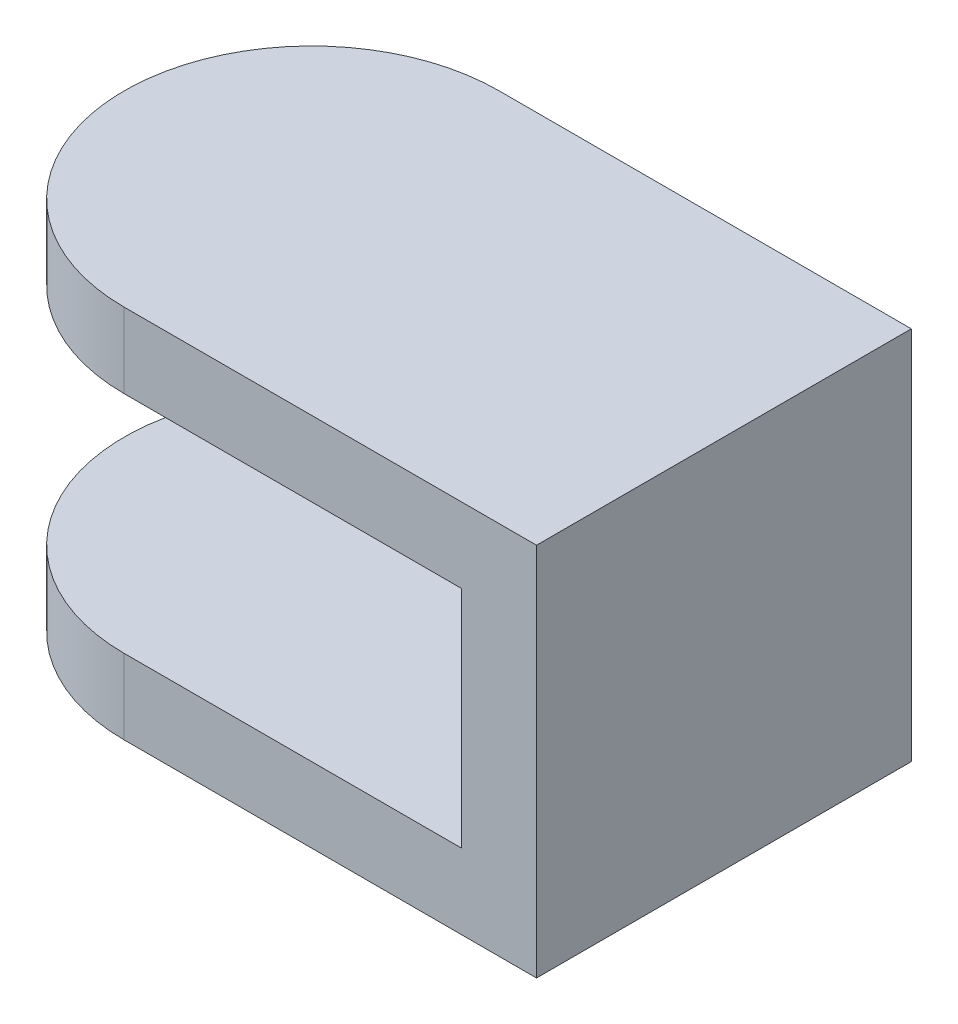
from build123d import *

# Parameters (mm, degrees)
EXTRU_MINCE1_DEPTH = 25
CONG_2_RADIUS      = 25
CONG_2_LENGTH      = 10
CONG_3_RADIUS      = 25
CONG_3_LENGTH      = 10


with BuildPart() as part:
    # Esquisse1 → Extru.-Mince1 (new, symmetric)
    with BuildSketch(Plane.XY):
        Polygon((-30, 25), (50, 25), (50, -25), (-30, -25), (-30, -15), (40, -15), (40, 15), (-30, 15), align=None)
    extrude(amount=EXTRU_MINCE1_DEPTH, both=True)

    # Cong_2: full round fillet: the end face becomes a half cylinder, R = half its width
    cong_2_face = Plane((-30, 20, 0), x_dir=(0, 1, 0), z_dir=(-1, 0, 0))  # on the end face: x along it, z out of the body
    cong_2_slab = cong_2_face.offset(-CONG_2_RADIUS / 2) * Box(CONG_2_LENGTH, 2 * CONG_2_RADIUS, CONG_2_RADIUS, mode=Mode.PRIVATE)  # the body's end, R deep
    cong_2_round = Plane((-5, 20, 0), x_dir=(-1, 0, 0), z_dir=(0, 1, 0)) * Cylinder(CONG_2_RADIUS, CONG_2_LENGTH, mode=Mode.PRIVATE)  # its axis R under the face
    add(cong_2_slab - cong_2_round, mode=Mode.SUBTRACT)

    # Cong_3: full round fillet: the end face becomes a half cylinder, R = half its width
    cong_3_face = Plane((-30, -20, 0), x_dir=(0, 1, 0), z_dir=(-1, 0, 0))  # on the end face: x along it, z out of the body
    cong_3_slab = cong_3_face.offset(-CONG_3_RADIUS / 2) * Box(CONG_3_LENGTH, 2 * CONG_3_RADIUS, CONG_3_RADIUS, mode=Mode.PRIVATE)  # the body's end, R deep
    cong_3_round = Plane((-5, -20, 0), x_dir=(-1, 0, 0), z_dir=(0, 1, 0)) * Cylinder(CONG_3_RADIUS, CONG_3_LENGTH, mode=Mode.PRIVATE)  # its axis R under the face
    add(cong_3_slab - cong_3_round, mode=Mode.SUBTRACT)


solid = part.part
